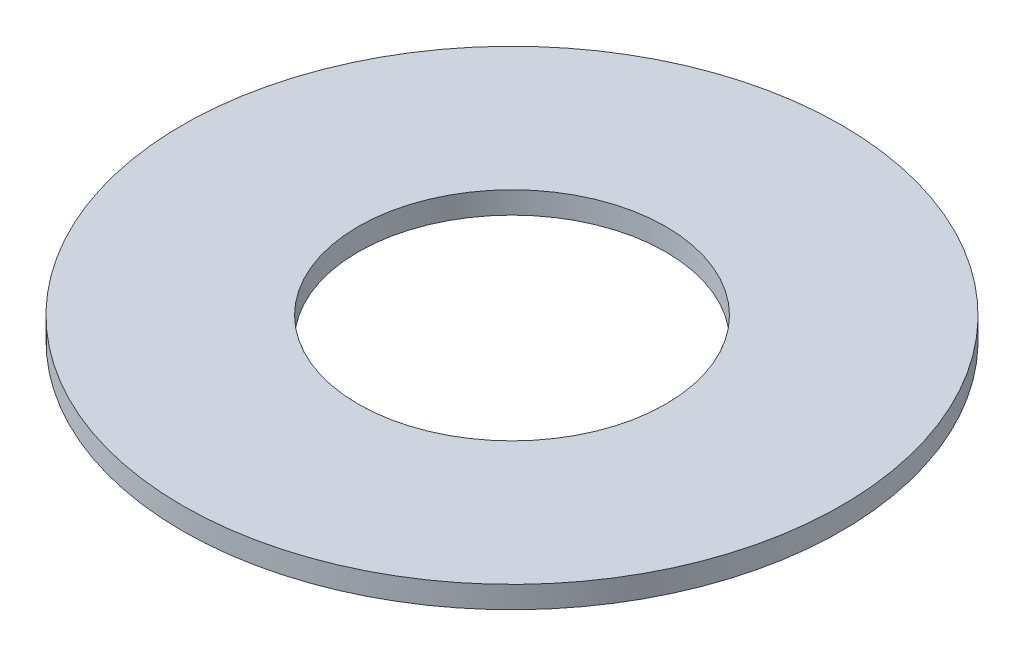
ISO-10303-21;
HEADER;
FILE_DESCRIPTION(('STEP AP214'),'2;1');
FILE_NAME('part.step','',(''),(''),'','','');
FILE_SCHEMA(('AUTOMOTIVE_DESIGN { 1 0 10303 214 1 1 1 1 }'));
ENDSEC;
DATA;
#1=APPLICATION_CONTEXT('core data for automotive mechanical design processes');
#2=APPLICATION_PROTOCOL_DEFINITION('international standard','automotive_design',2000,#1);
#3=PRODUCT_CONTEXT('',#1,'mechanical');
#4=PRODUCT('Part','Part','',(#3));
#5=PRODUCT_RELATED_PRODUCT_CATEGORY('part','',(#4));
#6=PRODUCT_DEFINITION_FORMATION('','',#4);
#7=PRODUCT_DEFINITION_CONTEXT('part definition',#1,'design');
#8=PRODUCT_DEFINITION('design','',#6,#7);
#9=PRODUCT_DEFINITION_SHAPE('','',#8);
#10=(LENGTH_UNIT() NAMED_UNIT(*) SI_UNIT(.MILLI.,.METRE.));
#11=(NAMED_UNIT(*) PLANE_ANGLE_UNIT() SI_UNIT($,.RADIAN.));
#12=(NAMED_UNIT(*) SI_UNIT($,.STERADIAN.) SOLID_ANGLE_UNIT());
#13=UNCERTAINTY_MEASURE_WITH_UNIT(LENGTH_MEASURE(1.E-05),#10,'distance_accuracy_value','');
#14=(GEOMETRIC_REPRESENTATION_CONTEXT(3) GLOBAL_UNCERTAINTY_ASSIGNED_CONTEXT((#13)) GLOBAL_UNIT_ASSIGNED_CONTEXT((#10,
#11,#12)) REPRESENTATION_CONTEXT('',''));
#15=CARTESIAN_POINT('',(0.,0.,0.));
#16=DIRECTION('',(0.,0.,1.));
#17=DIRECTION('',(1.,0.,0.));
#18=AXIS2_PLACEMENT_3D('',#15,#16,#17);
#19=CARTESIAN_POINT('',(0.,1.,0.));
#20=DIRECTION('',(0.,1.,0.));
#21=DIRECTION('',(0.,0.,1.));
#22=AXIS2_PLACEMENT_3D('',#19,#20,#21);
#23=PLANE('',#22);
#24=CARTESIAN_POINT('',(0.,1.,0.));
#25=DIRECTION('',(0.,1.,0.));
#26=DIRECTION('',(0.,0.,1.));
#27=AXIS2_PLACEMENT_3D('',#24,#25,#26);
#28=CIRCLE('',#27,15.);
#29=CARTESIAN_POINT('',(0.,1.,15.));
#30=VERTEX_POINT('',#29);
#31=EDGE_CURVE('E10',#30,#30,#28,.T.);
#32=ORIENTED_EDGE('',*,*,#31,.T.);
#33=EDGE_LOOP('',(#32));
#34=FACE_BOUND('',#33,.T.);
#35=CARTESIAN_POINT('',(0.,1.,0.));
#36=DIRECTION('',(0.,1.,0.));
#37=DIRECTION('',(0.,0.,1.));
#38=AXIS2_PLACEMENT_3D('',#35,#36,#37);
#39=CIRCLE('',#38,7.);
#40=CARTESIAN_POINT('',(0.,1.,7.));
#41=VERTEX_POINT('',#40);
#42=EDGE_CURVE('E42',#41,#41,#39,.T.);
#43=ORIENTED_EDGE('',*,*,#42,.F.);
#44=EDGE_LOOP('',(#43));
#45=FACE_BOUND('',#44,.T.);
#46=ADVANCED_FACE('F31',(#34,#45),#23,.T.);
#47=CARTESIAN_POINT('',(0.,0.,0.));
#48=DIRECTION('',(0.,1.,0.));
#49=DIRECTION('',(0.,0.,1.));
#50=AXIS2_PLACEMENT_3D('',#47,#48,#49);
#51=PLANE('',#50);
#52=CARTESIAN_POINT('',(0.,0.,0.));
#53=DIRECTION('',(0.,1.,0.));
#54=DIRECTION('',(0.,0.,1.));
#55=AXIS2_PLACEMENT_3D('',#52,#53,#54);
#56=CIRCLE('',#55,15.);
#57=CARTESIAN_POINT('',(0.,0.,15.));
#58=VERTEX_POINT('',#57);
#59=EDGE_CURVE('E35',#58,#58,#56,.T.);
#60=ORIENTED_EDGE('',*,*,#59,.F.);
#61=EDGE_LOOP('',(#60));
#62=FACE_BOUND('',#61,.T.);
#63=CARTESIAN_POINT('',(0.,0.,0.));
#64=DIRECTION('',(0.,1.,0.));
#65=DIRECTION('',(0.,0.,1.));
#66=AXIS2_PLACEMENT_3D('',#63,#64,#65);
#67=CIRCLE('',#66,7.);
#68=CARTESIAN_POINT('',(0.,0.,7.));
#69=VERTEX_POINT('',#68);
#70=EDGE_CURVE('E44',#69,#69,#67,.T.);
#71=ORIENTED_EDGE('',*,*,#70,.T.);
#72=EDGE_LOOP('',(#71));
#73=FACE_BOUND('',#72,.T.);
#74=ADVANCED_FACE('F54',(#62,#73),#51,.F.);
#75=CARTESIAN_POINT('',(0.,1.,0.));
#76=DIRECTION('',(0.,-1.,0.));
#77=DIRECTION('',(0.,0.,-1.));
#78=AXIS2_PLACEMENT_3D('',#75,#76,#77);
#79=CYLINDRICAL_SURFACE('',#78,15.);
#80=ORIENTED_EDGE('',*,*,#31,.F.);
#81=EDGE_LOOP('',(#80));
#82=FACE_BOUND('',#81,.T.);
#83=ORIENTED_EDGE('',*,*,#59,.T.);
#84=EDGE_LOOP('',(#83));
#85=FACE_BOUND('',#84,.T.);
#86=ADVANCED_FACE('F33',(#82,#85),#79,.T.);
#87=CARTESIAN_POINT('',(0.,1.,0.));
#88=DIRECTION('',(0.,-1.,0.));
#89=DIRECTION('',(0.,0.,-1.));
#90=AXIS2_PLACEMENT_3D('',#87,#88,#89);
#91=CYLINDRICAL_SURFACE('',#90,7.);
#92=ORIENTED_EDGE('',*,*,#42,.T.);
#93=EDGE_LOOP('',(#92));
#94=FACE_BOUND('',#93,.T.);
#95=ORIENTED_EDGE('',*,*,#70,.F.);
#96=EDGE_LOOP('',(#95));
#97=FACE_BOUND('',#96,.T.);
#98=ADVANCED_FACE('F50',(#94,#97),#91,.F.);
#99=CLOSED_SHELL('',(#46,#74,#86,#98));
#100=MANIFOLD_SOLID_BREP('B2',#99);
#101=ADVANCED_BREP_SHAPE_REPRESENTATION('',(#18,#100),#14);
#102=SHAPE_DEFINITION_REPRESENTATION(#9,#101);
ENDSEC;
END-ISO-10303-21;
